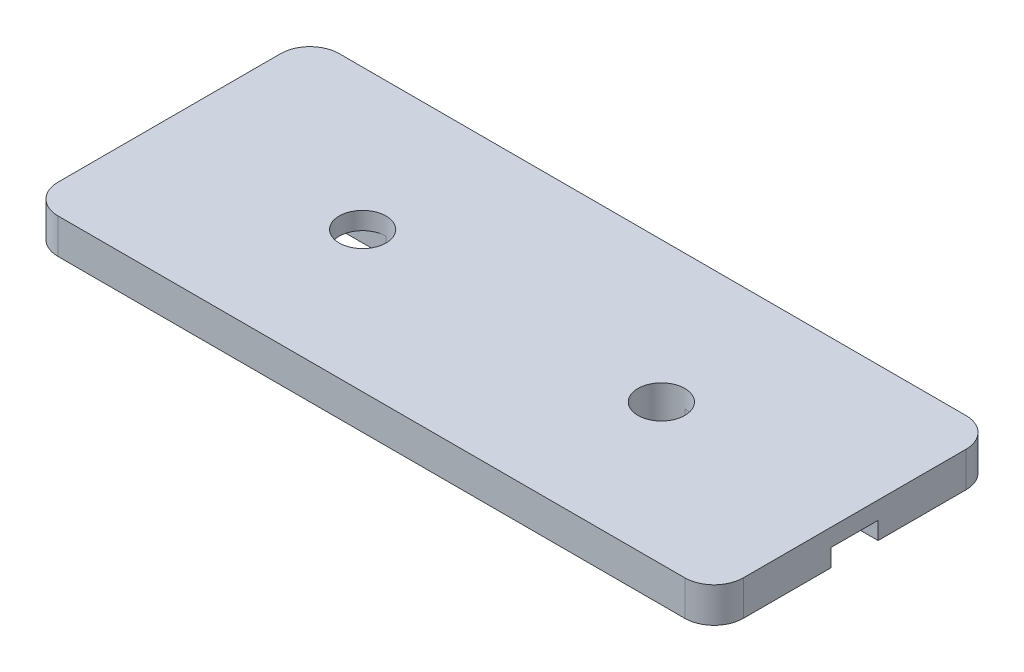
ISO-10303-21;
HEADER;
FILE_DESCRIPTION(('STEP AP214'),'2;1');
FILE_NAME('part.step','',(''),(''),'','','');
FILE_SCHEMA(('AUTOMOTIVE_DESIGN { 1 0 10303 214 1 1 1 1 }'));
ENDSEC;
DATA;
#1=APPLICATION_CONTEXT('core data for automotive mechanical design processes');
#2=APPLICATION_PROTOCOL_DEFINITION('international standard','automotive_design',2000,#1);
#3=PRODUCT_CONTEXT('',#1,'mechanical');
#4=PRODUCT('Part','Part','',(#3));
#5=PRODUCT_RELATED_PRODUCT_CATEGORY('part','',(#4));
#6=PRODUCT_DEFINITION_FORMATION('','',#4);
#7=PRODUCT_DEFINITION_CONTEXT('part definition',#1,'design');
#8=PRODUCT_DEFINITION('design','',#6,#7);
#9=PRODUCT_DEFINITION_SHAPE('','',#8);
#10=(LENGTH_UNIT() NAMED_UNIT(*) SI_UNIT(.MILLI.,.METRE.));
#11=(NAMED_UNIT(*) PLANE_ANGLE_UNIT() SI_UNIT($,.RADIAN.));
#12=(NAMED_UNIT(*) SI_UNIT($,.STERADIAN.) SOLID_ANGLE_UNIT());
#13=UNCERTAINTY_MEASURE_WITH_UNIT(LENGTH_MEASURE(1.E-05),#10,'distance_accuracy_value','');
#14=(GEOMETRIC_REPRESENTATION_CONTEXT(3) GLOBAL_UNCERTAINTY_ASSIGNED_CONTEXT((#13)) GLOBAL_UNIT_ASSIGNED_CONTEXT((#10,
#11,#12)) REPRESENTATION_CONTEXT('',''));
#15=CARTESIAN_POINT('',(0.,0.,0.));
#16=DIRECTION('',(0.,0.,1.));
#17=DIRECTION('',(1.,0.,0.));
#18=AXIS2_PLACEMENT_3D('',#15,#16,#17);
#19=CARTESIAN_POINT('',(-5.85,0.6,-2.4));
#20=DIRECTION('',(1.,0.,0.));
#21=DIRECTION('',(0.,0.,-1.));
#22=AXIS2_PLACEMENT_3D('',#19,#20,#21);
#23=PLANE('',#22);
#24=DIRECTION('',(0.,0.,1.));
#25=VECTOR('',#24,1.);
#26=CARTESIAN_POINT('',(-5.85,0.,-2.4));
#27=LINE('',#26,#25);
#28=CARTESIAN_POINT('',(-5.85,0.,-1.9));
#29=VERTEX_POINT('',#28);
#30=CARTESIAN_POINT('',(-5.85,0.,-0.399999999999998));
#31=VERTEX_POINT('',#30);
#32=EDGE_CURVE('E227',#29,#31,#27,.T.);
#33=ORIENTED_EDGE('',*,*,#32,.T.);
#34=DIRECTION('',(0.,-1.,0.));
#35=VECTOR('',#34,1.);
#36=CARTESIAN_POINT('',(-5.85,0.3,-0.399999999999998));
#37=LINE('',#36,#35);
#38=CARTESIAN_POINT('',(-5.85,0.3,-0.399999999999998));
#39=VERTEX_POINT('',#38);
#40=EDGE_CURVE('E269',#39,#31,#37,.T.);
#41=ORIENTED_EDGE('',*,*,#40,.F.);
#42=DIRECTION('',(0.,0.,-1.));
#43=VECTOR('',#42,1.);
#44=CARTESIAN_POINT('',(-5.85,0.3,-0.399999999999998));
#45=LINE('',#44,#43);
#46=CARTESIAN_POINT('',(-5.85,0.3,0.400000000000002));
#47=VERTEX_POINT('',#46);
#48=EDGE_CURVE('E257',#47,#39,#45,.T.);
#49=ORIENTED_EDGE('',*,*,#48,.F.);
#50=DIRECTION('',(0.,1.,0.));
#51=VECTOR('',#50,1.);
#52=CARTESIAN_POINT('',(-5.85,0.3,0.400000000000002));
#53=LINE('',#52,#51);
#54=CARTESIAN_POINT('',(-5.85,0.,0.400000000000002));
#55=VERTEX_POINT('',#54);
#56=EDGE_CURVE('E266',#55,#47,#53,.T.);
#57=ORIENTED_EDGE('',*,*,#56,.F.);
#58=CARTESIAN_POINT('',(-5.85,0.,1.9));
#59=VERTEX_POINT('',#58);
#60=EDGE_CURVE('E229',#55,#59,#27,.T.);
#61=ORIENTED_EDGE('',*,*,#60,.T.);
#62=DIRECTION('',(0.,-1.,0.));
#63=VECTOR('',#62,1.);
#64=CARTESIAN_POINT('',(-5.85,0.6,1.9));
#65=LINE('',#64,#63);
#66=CARTESIAN_POINT('',(-5.85,0.6,1.9));
#67=VERTEX_POINT('',#66);
#68=EDGE_CURVE('E182',#59,#67,#65,.F.);
#69=ORIENTED_EDGE('',*,*,#68,.T.);
#70=DIRECTION('',(0.,0.,1.));
#71=VECTOR('',#70,1.);
#72=CARTESIAN_POINT('',(-5.85,0.6,-2.4));
#73=LINE('',#72,#71);
#74=CARTESIAN_POINT('',(-5.85,0.6,-1.9));
#75=VERTEX_POINT('',#74);
#76=EDGE_CURVE('E176',#75,#67,#73,.T.);
#77=ORIENTED_EDGE('',*,*,#76,.F.);
#78=DIRECTION('',(0.,-1.,0.));
#79=VECTOR('',#78,1.);
#80=CARTESIAN_POINT('',(-5.85,0.6,-1.9));
#81=LINE('',#80,#79);
#82=EDGE_CURVE('E184',#75,#29,#81,.T.);
#83=ORIENTED_EDGE('',*,*,#82,.T.);
#84=EDGE_LOOP('',(#33,#41,#49,#57,#61,#69,#77,#83));
#85=FACE_BOUND('',#84,.T.);
#86=ADVANCED_FACE('F31',(#85),#23,.F.);
#87=CARTESIAN_POINT('',(-5.85,0.6,2.4));
#88=DIRECTION('',(0.,0.,-1.));
#89=DIRECTION('',(-1.,0.,0.));
#90=AXIS2_PLACEMENT_3D('',#87,#88,#89);
#91=PLANE('',#90);
#92=DIRECTION('',(1.,0.,0.));
#93=VECTOR('',#92,1.);
#94=CARTESIAN_POINT('',(-5.85,0.,2.4));
#95=LINE('',#94,#93);
#96=CARTESIAN_POINT('',(-5.35,0.,2.4));
#97=VERTEX_POINT('',#96);
#98=CARTESIAN_POINT('',(5.35,0.,2.4));
#99=VERTEX_POINT('',#98);
#100=EDGE_CURVE('E178',#97,#99,#95,.T.);
#101=ORIENTED_EDGE('',*,*,#100,.T.);
#102=DIRECTION('',(0.,-1.,0.));
#103=VECTOR('',#102,1.);
#104=CARTESIAN_POINT('',(5.35,0.6,2.4));
#105=LINE('',#104,#103);
#106=CARTESIAN_POINT('',(5.35,0.6,2.4));
#107=VERTEX_POINT('',#106);
#108=EDGE_CURVE('E11',#99,#107,#105,.F.);
#109=ORIENTED_EDGE('',*,*,#108,.T.);
#110=DIRECTION('',(1.,0.,0.));
#111=VECTOR('',#110,1.);
#112=CARTESIAN_POINT('',(-5.85,0.6,2.4));
#113=LINE('',#112,#111);
#114=CARTESIAN_POINT('',(-5.35,0.6,2.4));
#115=VERTEX_POINT('',#114);
#116=EDGE_CURVE('E222',#115,#107,#113,.T.);
#117=ORIENTED_EDGE('',*,*,#116,.F.);
#118=DIRECTION('',(0.,-1.,0.));
#119=VECTOR('',#118,1.);
#120=CARTESIAN_POINT('',(-5.35,0.6,2.4));
#121=LINE('',#120,#119);
#122=EDGE_CURVE('E39',#115,#97,#121,.T.);
#123=ORIENTED_EDGE('',*,*,#122,.T.);
#124=EDGE_LOOP('',(#101,#109,#117,#123));
#125=FACE_BOUND('',#124,.T.);
#126=ADVANCED_FACE('F219',(#125),#91,.F.);
#127=CARTESIAN_POINT('',(5.85,0.6,-2.4));
#128=DIRECTION('',(-1.,0.,0.));
#129=DIRECTION('',(0.,0.,1.));
#130=AXIS2_PLACEMENT_3D('',#127,#128,#129);
#131=PLANE('',#130);
#132=DIRECTION('',(0.,0.,-1.));
#133=VECTOR('',#132,1.);
#134=CARTESIAN_POINT('',(5.85,0.,-2.4));
#135=LINE('',#134,#133);
#136=CARTESIAN_POINT('',(5.85,0.,1.9));
#137=VERTEX_POINT('',#136);
#138=CARTESIAN_POINT('',(5.85,0.,0.400000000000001));
#139=VERTEX_POINT('',#138);
#140=EDGE_CURVE('E160',#137,#139,#135,.T.);
#141=ORIENTED_EDGE('',*,*,#140,.T.);
#142=DIRECTION('',(0.,-1.,0.));
#143=VECTOR('',#142,1.);
#144=CARTESIAN_POINT('',(5.85,0.3,0.400000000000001));
#145=LINE('',#144,#143);
#146=CARTESIAN_POINT('',(5.85,0.3,0.400000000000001));
#147=VERTEX_POINT('',#146);
#148=EDGE_CURVE('E142',#147,#139,#145,.T.);
#149=ORIENTED_EDGE('',*,*,#148,.F.);
#150=DIRECTION('',(0.,0.,1.));
#151=VECTOR('',#150,1.);
#152=CARTESIAN_POINT('',(5.85,0.3,0.400000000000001));
#153=LINE('',#152,#151);
#154=CARTESIAN_POINT('',(5.85,0.3,-0.399999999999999));
#155=VERTEX_POINT('',#154);
#156=EDGE_CURVE('E165',#155,#147,#153,.T.);
#157=ORIENTED_EDGE('',*,*,#156,.F.);
#158=DIRECTION('',(0.,1.,0.));
#159=VECTOR('',#158,1.);
#160=CARTESIAN_POINT('',(5.85,0.3,-0.399999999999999));
#161=LINE('',#160,#159);
#162=CARTESIAN_POINT('',(5.85,0.,-0.399999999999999));
#163=VERTEX_POINT('',#162);
#164=EDGE_CURVE('E153',#163,#155,#161,.T.);
#165=ORIENTED_EDGE('',*,*,#164,.F.);
#166=CARTESIAN_POINT('',(5.85,0.,-1.9));
#167=VERTEX_POINT('',#166);
#168=EDGE_CURVE('E173',#163,#167,#135,.T.);
#169=ORIENTED_EDGE('',*,*,#168,.T.);
#170=DIRECTION('',(0.,-1.,0.));
#171=VECTOR('',#170,1.);
#172=CARTESIAN_POINT('',(5.85,0.6,-1.9));
#173=LINE('',#172,#171);
#174=CARTESIAN_POINT('',(5.85,0.6,-1.9));
#175=VERTEX_POINT('',#174);
#176=EDGE_CURVE('E212',#167,#175,#173,.F.);
#177=ORIENTED_EDGE('',*,*,#176,.T.);
#178=DIRECTION('',(0.,0.,-1.));
#179=VECTOR('',#178,1.);
#180=CARTESIAN_POINT('',(5.85,0.6,-2.4));
#181=LINE('',#180,#179);
#182=CARTESIAN_POINT('',(5.85,0.6,1.9));
#183=VERTEX_POINT('',#182);
#184=EDGE_CURVE('E237',#183,#175,#181,.T.);
#185=ORIENTED_EDGE('',*,*,#184,.F.);
#186=DIRECTION('',(0.,-1.,0.));
#187=VECTOR('',#186,1.);
#188=CARTESIAN_POINT('',(5.85,0.6,1.9));
#189=LINE('',#188,#187);
#190=EDGE_CURVE('E171',#183,#137,#189,.T.);
#191=ORIENTED_EDGE('',*,*,#190,.T.);
#192=EDGE_LOOP('',(#141,#149,#157,#165,#169,#177,#185,#191));
#193=FACE_BOUND('',#192,.T.);
#194=ADVANCED_FACE('F168',(#193),#131,.F.);
#195=CARTESIAN_POINT('',(-5.85,0.6,-2.4));
#196=DIRECTION('',(0.,0.,1.));
#197=DIRECTION('',(1.,0.,0.));
#198=AXIS2_PLACEMENT_3D('',#195,#196,#197);
#199=PLANE('',#198);
#200=DIRECTION('',(-1.,0.,0.));
#201=VECTOR('',#200,1.);
#202=CARTESIAN_POINT('',(-5.85,0.,-2.4));
#203=LINE('',#202,#201);
#204=CARTESIAN_POINT('',(5.35,0.,-2.4));
#205=VERTEX_POINT('',#204);
#206=CARTESIAN_POINT('',(-5.35,0.,-2.4));
#207=VERTEX_POINT('',#206);
#208=EDGE_CURVE('E172',#205,#207,#203,.T.);
#209=ORIENTED_EDGE('',*,*,#208,.T.);
#210=DIRECTION('',(0.,-1.,0.));
#211=VECTOR('',#210,1.);
#212=CARTESIAN_POINT('',(-5.35,0.6,-2.4));
#213=LINE('',#212,#211);
#214=CARTESIAN_POINT('',(-5.35,0.6,-2.4));
#215=VERTEX_POINT('',#214);
#216=EDGE_CURVE('E201',#207,#215,#213,.F.);
#217=ORIENTED_EDGE('',*,*,#216,.T.);
#218=DIRECTION('',(-1.,0.,0.));
#219=VECTOR('',#218,1.);
#220=CARTESIAN_POINT('',(-5.85,0.6,-2.4));
#221=LINE('',#220,#219);
#222=CARTESIAN_POINT('',(5.35,0.6,-2.4));
#223=VERTEX_POINT('',#222);
#224=EDGE_CURVE('E185',#223,#215,#221,.T.);
#225=ORIENTED_EDGE('',*,*,#224,.F.);
#226=DIRECTION('',(0.,-1.,0.));
#227=VECTOR('',#226,1.);
#228=CARTESIAN_POINT('',(5.35,0.6,-2.4));
#229=LINE('',#228,#227);
#230=EDGE_CURVE('E198',#223,#205,#229,.T.);
#231=ORIENTED_EDGE('',*,*,#230,.T.);
#232=EDGE_LOOP('',(#209,#217,#225,#231));
#233=FACE_BOUND('',#232,.T.);
#234=ADVANCED_FACE('F346',(#233),#199,.F.);
#235=CARTESIAN_POINT('',(-5.85,0.6,2.4));
#236=DIRECTION('',(0.,1.,0.));
#237=DIRECTION('',(0.,0.,1.));
#238=AXIS2_PLACEMENT_3D('',#235,#236,#237);
#239=PLANE('',#238);
#240=CARTESIAN_POINT('',(2.55,0.6,0.));
#241=DIRECTION('',(0.,1.,0.));
#242=DIRECTION('',(0.,0.,1.));
#243=AXIS2_PLACEMENT_3D('',#240,#241,#242);
#244=CIRCLE('',#243,0.4);
#245=CARTESIAN_POINT('',(2.55,0.6,0.4));
#246=VERTEX_POINT('',#245);
#247=EDGE_CURVE('E248',#246,#246,#244,.T.);
#248=ORIENTED_EDGE('',*,*,#247,.F.);
#249=EDGE_LOOP('',(#248));
#250=FACE_BOUND('',#249,.T.);
#251=CARTESIAN_POINT('',(-2.55,0.6,0.));
#252=DIRECTION('',(0.,1.,0.));
#253=DIRECTION('',(0.,0.,1.));
#254=AXIS2_PLACEMENT_3D('',#251,#252,#253);
#255=CIRCLE('',#254,0.4);
#256=CARTESIAN_POINT('',(-2.55,0.6,0.4));
#257=VERTEX_POINT('',#256);
#258=EDGE_CURVE('E243',#257,#257,#255,.T.);
#259=ORIENTED_EDGE('',*,*,#258,.F.);
#260=EDGE_LOOP('',(#259));
#261=FACE_BOUND('',#260,.T.);
#262=ORIENTED_EDGE('',*,*,#224,.T.);
#263=CARTESIAN_POINT('',(-5.35,0.6,-1.9));
#264=DIRECTION('',(0.,1.,0.));
#265=DIRECTION('',(0.,0.,1.));
#266=AXIS2_PLACEMENT_3D('',#263,#264,#265);
#267=CIRCLE('',#266,0.5);
#268=EDGE_CURVE('E209',#215,#75,#267,.T.);
#269=ORIENTED_EDGE('',*,*,#268,.T.);
#270=ORIENTED_EDGE('',*,*,#76,.T.);
#271=CARTESIAN_POINT('',(-5.35,0.6,1.9));
#272=DIRECTION('',(0.,1.,0.));
#273=DIRECTION('',(0.,0.,1.));
#274=AXIS2_PLACEMENT_3D('',#271,#272,#273);
#275=CIRCLE('',#274,0.5);
#276=EDGE_CURVE('E203',#67,#115,#275,.T.);
#277=ORIENTED_EDGE('',*,*,#276,.T.);
#278=ORIENTED_EDGE('',*,*,#116,.T.);
#279=CARTESIAN_POINT('',(5.35,0.6,1.9));
#280=DIRECTION('',(0.,1.,0.));
#281=DIRECTION('',(0.,0.,1.));
#282=AXIS2_PLACEMENT_3D('',#279,#280,#281);
#283=CIRCLE('',#282,0.5);
#284=EDGE_CURVE('E205',#107,#183,#283,.T.);
#285=ORIENTED_EDGE('',*,*,#284,.T.);
#286=ORIENTED_EDGE('',*,*,#184,.T.);
#287=CARTESIAN_POINT('',(5.35,0.6,-1.9));
#288=DIRECTION('',(0.,1.,0.));
#289=DIRECTION('',(0.,0.,1.));
#290=AXIS2_PLACEMENT_3D('',#287,#288,#289);
#291=CIRCLE('',#290,0.5);
#292=EDGE_CURVE('E207',#175,#223,#291,.T.);
#293=ORIENTED_EDGE('',*,*,#292,.T.);
#294=EDGE_LOOP('',(#262,#269,#270,#277,#278,#285,#286,#293));
#295=FACE_BOUND('',#294,.T.);
#296=ADVANCED_FACE('F330',(#250,#261,#295),#239,.T.);
#297=CARTESIAN_POINT('',(-5.85,0.,2.4));
#298=DIRECTION('',(0.,1.,0.));
#299=DIRECTION('',(0.,0.,1.));
#300=AXIS2_PLACEMENT_3D('',#297,#298,#299);
#301=PLANE('',#300);
#302=CARTESIAN_POINT('',(2.55,0.,0.));
#303=DIRECTION('',(0.,1.,0.));
#304=DIRECTION('',(0.,0.,1.));
#305=AXIS2_PLACEMENT_3D('',#302,#303,#304);
#306=CIRCLE('',#305,0.4);
#307=CARTESIAN_POINT('',(2.55,0.,-0.4));
#308=VERTEX_POINT('',#307);
#309=CARTESIAN_POINT('',(2.55,0.,0.4));
#310=VERTEX_POINT('',#309);
#311=EDGE_CURVE('E163',#308,#310,#306,.T.);
#312=ORIENTED_EDGE('',*,*,#311,.T.);
#313=DIRECTION('',(1.,0.,0.));
#314=VECTOR('',#313,1.);
#315=CARTESIAN_POINT('',(-5.851,0.,0.399999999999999));
#316=LINE('',#315,#314);
#317=EDGE_CURVE('E146',#310,#139,#316,.T.);
#318=ORIENTED_EDGE('',*,*,#317,.T.);
#319=ORIENTED_EDGE('',*,*,#140,.F.);
#320=CARTESIAN_POINT('',(5.35,0.,1.9));
#321=DIRECTION('',(0.,1.,0.));
#322=DIRECTION('',(0.,0.,1.));
#323=AXIS2_PLACEMENT_3D('',#320,#321,#322);
#324=CIRCLE('',#323,0.5);
#325=EDGE_CURVE('E191',#137,#99,#324,.F.);
#326=ORIENTED_EDGE('',*,*,#325,.T.);
#327=ORIENTED_EDGE('',*,*,#100,.F.);
#328=CARTESIAN_POINT('',(-5.35,0.,1.9));
#329=DIRECTION('',(0.,1.,0.));
#330=DIRECTION('',(0.,0.,1.));
#331=AXIS2_PLACEMENT_3D('',#328,#329,#330);
#332=CIRCLE('',#331,0.5);
#333=EDGE_CURVE('E188',#97,#59,#332,.F.);
#334=ORIENTED_EDGE('',*,*,#333,.T.);
#335=ORIENTED_EDGE('',*,*,#60,.F.);
#336=DIRECTION('',(-1.,0.,0.));
#337=VECTOR('',#336,1.);
#338=CARTESIAN_POINT('',(5.851,0.,0.399999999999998));
#339=LINE('',#338,#337);
#340=CARTESIAN_POINT('',(-2.55,0.,0.400000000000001));
#341=VERTEX_POINT('',#340);
#342=EDGE_CURVE('E256',#341,#55,#339,.T.);
#343=ORIENTED_EDGE('',*,*,#342,.F.);
#344=CARTESIAN_POINT('',(-2.55,0.,0.));
#345=DIRECTION('',(0.,1.,0.));
#346=DIRECTION('',(0.,0.,1.));
#347=AXIS2_PLACEMENT_3D('',#344,#345,#346);
#348=CIRCLE('',#347,0.4);
#349=CARTESIAN_POINT('',(-2.55,0.,-0.4));
#350=VERTEX_POINT('',#349);
#351=EDGE_CURVE('E233',#341,#350,#348,.T.);
#352=ORIENTED_EDGE('',*,*,#351,.T.);
#353=DIRECTION('',(-1.,0.,0.));
#354=VECTOR('',#353,1.);
#355=CARTESIAN_POINT('',(5.851,0.,-0.400000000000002));
#356=LINE('',#355,#354);
#357=EDGE_CURVE('E253',#350,#31,#356,.T.);
#358=ORIENTED_EDGE('',*,*,#357,.T.);
#359=ORIENTED_EDGE('',*,*,#32,.F.);
#360=CARTESIAN_POINT('',(-5.35,0.,-1.9));
#361=DIRECTION('',(0.,1.,0.));
#362=DIRECTION('',(0.,0.,1.));
#363=AXIS2_PLACEMENT_3D('',#360,#361,#362);
#364=CIRCLE('',#363,0.5);
#365=EDGE_CURVE('E196',#29,#207,#364,.F.);
#366=ORIENTED_EDGE('',*,*,#365,.T.);
#367=ORIENTED_EDGE('',*,*,#208,.F.);
#368=CARTESIAN_POINT('',(5.35,0.,-1.9));
#369=DIRECTION('',(0.,1.,0.));
#370=DIRECTION('',(0.,0.,1.));
#371=AXIS2_PLACEMENT_3D('',#368,#369,#370);
#372=CIRCLE('',#371,0.5);
#373=EDGE_CURVE('E193',#205,#167,#372,.F.);
#374=ORIENTED_EDGE('',*,*,#373,.T.);
#375=ORIENTED_EDGE('',*,*,#168,.F.);
#376=DIRECTION('',(1.,0.,0.));
#377=VECTOR('',#376,1.);
#378=CARTESIAN_POINT('',(-5.851,0.,-0.400000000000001));
#379=LINE('',#378,#377);
#380=EDGE_CURVE('E164',#308,#163,#379,.T.);
#381=ORIENTED_EDGE('',*,*,#380,.F.);
#382=EDGE_LOOP('',(#312,#318,#319,#326,#327,#334,#335,#343,#352,#358,#359,#366,#367,#374,#375,#381));
#383=FACE_BOUND('',#382,.T.);
#384=ADVANCED_FACE('F159',(#383),#301,.F.);
#385=CARTESIAN_POINT('',(-5.35,0.6,-1.9));
#386=DIRECTION('',(0.,-1.,0.));
#387=DIRECTION('',(0.,0.,-1.));
#388=AXIS2_PLACEMENT_3D('',#385,#386,#387);
#389=CYLINDRICAL_SURFACE('',#388,0.5);
#390=ORIENTED_EDGE('',*,*,#268,.F.);
#391=ORIENTED_EDGE('',*,*,#216,.F.);
#392=ORIENTED_EDGE('',*,*,#365,.F.);
#393=ORIENTED_EDGE('',*,*,#82,.F.);
#394=EDGE_LOOP('',(#390,#391,#392,#393));
#395=FACE_BOUND('',#394,.T.);
#396=ADVANCED_FACE('F314',(#395),#389,.T.);
#397=CARTESIAN_POINT('',(5.35,0.6,-1.9));
#398=DIRECTION('',(0.,-1.,0.));
#399=DIRECTION('',(0.,0.,-1.));
#400=AXIS2_PLACEMENT_3D('',#397,#398,#399);
#401=CYLINDRICAL_SURFACE('',#400,0.5);
#402=ORIENTED_EDGE('',*,*,#292,.F.);
#403=ORIENTED_EDGE('',*,*,#176,.F.);
#404=ORIENTED_EDGE('',*,*,#373,.F.);
#405=ORIENTED_EDGE('',*,*,#230,.F.);
#406=EDGE_LOOP('',(#402,#403,#404,#405));
#407=FACE_BOUND('',#406,.T.);
#408=ADVANCED_FACE('F317',(#407),#401,.T.);
#409=CARTESIAN_POINT('',(5.35,0.6,1.9));
#410=DIRECTION('',(0.,-1.,0.));
#411=DIRECTION('',(0.,0.,-1.));
#412=AXIS2_PLACEMENT_3D('',#409,#410,#411);
#413=CYLINDRICAL_SURFACE('',#412,0.5);
#414=ORIENTED_EDGE('',*,*,#284,.F.);
#415=ORIENTED_EDGE('',*,*,#108,.F.);
#416=ORIENTED_EDGE('',*,*,#325,.F.);
#417=ORIENTED_EDGE('',*,*,#190,.F.);
#418=EDGE_LOOP('',(#414,#415,#416,#417));
#419=FACE_BOUND('',#418,.T.);
#420=ADVANCED_FACE('F320',(#419),#413,.T.);
#421=CARTESIAN_POINT('',(-5.35,0.6,1.9));
#422=DIRECTION('',(0.,-1.,0.));
#423=DIRECTION('',(0.,0.,-1.));
#424=AXIS2_PLACEMENT_3D('',#421,#422,#423);
#425=CYLINDRICAL_SURFACE('',#424,0.5);
#426=ORIENTED_EDGE('',*,*,#276,.F.);
#427=ORIENTED_EDGE('',*,*,#68,.F.);
#428=ORIENTED_EDGE('',*,*,#333,.F.);
#429=ORIENTED_EDGE('',*,*,#122,.F.);
#430=EDGE_LOOP('',(#426,#427,#428,#429));
#431=FACE_BOUND('',#430,.T.);
#432=ADVANCED_FACE('F33',(#431),#425,.T.);
#433=CARTESIAN_POINT('',(-2.55,0.,0.));
#434=DIRECTION('',(0.,1.,0.));
#435=DIRECTION('',(0.,0.,1.));
#436=AXIS2_PLACEMENT_3D('',#433,#434,#435);
#437=CYLINDRICAL_SURFACE('',#436,0.4);
#438=CARTESIAN_POINT('',(-2.55,0.3,0.));
#439=DIRECTION('',(0.,1.,0.));
#440=DIRECTION('',(0.,0.,1.));
#441=AXIS2_PLACEMENT_3D('',#438,#439,#440);
#442=CIRCLE('',#441,0.4);
#443=CARTESIAN_POINT('',(-2.55,0.3,-0.399999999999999));
#444=VERTEX_POINT('',#443);
#445=CARTESIAN_POINT('',(-2.55,0.3,0.400000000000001));
#446=VERTEX_POINT('',#445);
#447=EDGE_CURVE('E54',#444,#446,#442,.T.);
#448=ORIENTED_EDGE('',*,*,#447,.F.);
#449=DIRECTION('',(0.,1.,0.));
#450=VECTOR('',#449,1.);
#451=CARTESIAN_POINT('',(-2.55,0.,-0.4));
#452=LINE('',#451,#450);
#453=EDGE_CURVE('E263',#350,#444,#452,.T.);
#454=ORIENTED_EDGE('',*,*,#453,.F.);
#455=ORIENTED_EDGE('',*,*,#351,.F.);
#456=DIRECTION('',(0.,1.,0.));
#457=VECTOR('',#456,1.);
#458=CARTESIAN_POINT('',(-2.55,0.,0.400000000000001));
#459=LINE('',#458,#457);
#460=EDGE_CURVE('E251',#341,#446,#459,.T.);
#461=ORIENTED_EDGE('',*,*,#460,.T.);
#462=EDGE_LOOP('',(#448,#454,#455,#461));
#463=FACE_BOUND('',#462,.T.);
#464=ORIENTED_EDGE('',*,*,#258,.T.);
#465=EDGE_LOOP('',(#464));
#466=FACE_BOUND('',#465,.T.);
#467=ADVANCED_FACE('F327',(#463,#466),#437,.F.);
#468=CARTESIAN_POINT('',(2.55,0.,0.));
#469=DIRECTION('',(0.,1.,0.));
#470=DIRECTION('',(0.,0.,1.));
#471=AXIS2_PLACEMENT_3D('',#468,#469,#470);
#472=CYLINDRICAL_SURFACE('',#471,0.4);
#473=CARTESIAN_POINT('',(2.55,0.3,0.));
#474=DIRECTION('',(0.,1.,0.));
#475=DIRECTION('',(0.,0.,1.));
#476=AXIS2_PLACEMENT_3D('',#473,#474,#475);
#477=CIRCLE('',#476,0.4);
#478=CARTESIAN_POINT('',(2.55,0.3,0.400000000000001));
#479=VERTEX_POINT('',#478);
#480=CARTESIAN_POINT('',(2.55,0.3,-0.4));
#481=VERTEX_POINT('',#480);
#482=EDGE_CURVE('E46',#479,#481,#477,.T.);
#483=ORIENTED_EDGE('',*,*,#482,.F.);
#484=DIRECTION('',(0.,1.,0.));
#485=VECTOR('',#484,1.);
#486=CARTESIAN_POINT('',(2.55,0.,0.400000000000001));
#487=LINE('',#486,#485);
#488=EDGE_CURVE('E154',#310,#479,#487,.T.);
#489=ORIENTED_EDGE('',*,*,#488,.F.);
#490=ORIENTED_EDGE('',*,*,#311,.F.);
#491=DIRECTION('',(0.,1.,0.));
#492=VECTOR('',#491,1.);
#493=CARTESIAN_POINT('',(2.55,0.,-0.4));
#494=LINE('',#493,#492);
#495=EDGE_CURVE('E285',#308,#481,#494,.T.);
#496=ORIENTED_EDGE('',*,*,#495,.T.);
#497=EDGE_LOOP('',(#483,#489,#490,#496));
#498=FACE_BOUND('',#497,.T.);
#499=ORIENTED_EDGE('',*,*,#247,.T.);
#500=EDGE_LOOP('',(#499));
#501=FACE_BOUND('',#500,.T.);
#502=ADVANCED_FACE('F288',(#498,#501),#472,.F.);
#503=CARTESIAN_POINT('',(5.851,0.3,-0.400000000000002));
#504=DIRECTION('',(0.,0.,-1.));
#505=DIRECTION('',(0.,1.,0.));
#506=AXIS2_PLACEMENT_3D('',#503,#504,#505);
#507=PLANE('',#506);
#508=ORIENTED_EDGE('',*,*,#453,.T.);
#509=DIRECTION('',(-1.,0.,0.));
#510=VECTOR('',#509,1.);
#511=CARTESIAN_POINT('',(5.851,0.3,-0.400000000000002));
#512=LINE('',#511,#510);
#513=EDGE_CURVE('E261',#444,#39,#512,.T.);
#514=ORIENTED_EDGE('',*,*,#513,.T.);
#515=ORIENTED_EDGE('',*,*,#40,.T.);
#516=ORIENTED_EDGE('',*,*,#357,.F.);
#517=EDGE_LOOP('',(#508,#514,#515,#516));
#518=FACE_BOUND('',#517,.T.);
#519=ADVANCED_FACE('F343',(#518),#507,.F.);
#520=CARTESIAN_POINT('',(5.851,0.3,-0.400000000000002));
#521=DIRECTION('',(0.,1.,0.));
#522=DIRECTION('',(0.,0.,1.));
#523=AXIS2_PLACEMENT_3D('',#520,#521,#522);
#524=PLANE('',#523);
#525=ORIENTED_EDGE('',*,*,#447,.T.);
#526=DIRECTION('',(-1.,0.,0.));
#527=VECTOR('',#526,1.);
#528=CARTESIAN_POINT('',(5.851,0.3,0.399999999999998));
#529=LINE('',#528,#527);
#530=EDGE_CURVE('E259',#446,#47,#529,.T.);
#531=ORIENTED_EDGE('',*,*,#530,.T.);
#532=ORIENTED_EDGE('',*,*,#48,.T.);
#533=ORIENTED_EDGE('',*,*,#513,.F.);
#534=EDGE_LOOP('',(#525,#531,#532,#533));
#535=FACE_BOUND('',#534,.T.);
#536=ADVANCED_FACE('F367',(#535),#524,.F.);
#537=CARTESIAN_POINT('',(5.851,0.3,0.399999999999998));
#538=DIRECTION('',(0.,0.,1.));
#539=DIRECTION('',(1.,0.,0.));
#540=AXIS2_PLACEMENT_3D('',#537,#538,#539);
#541=PLANE('',#540);
#542=ORIENTED_EDGE('',*,*,#342,.T.);
#543=ORIENTED_EDGE('',*,*,#56,.T.);
#544=ORIENTED_EDGE('',*,*,#530,.F.);
#545=ORIENTED_EDGE('',*,*,#460,.F.);
#546=EDGE_LOOP('',(#542,#543,#544,#545));
#547=FACE_BOUND('',#546,.T.);
#548=ADVANCED_FACE('F304',(#547),#541,.F.);
#549=CARTESIAN_POINT('',(-5.851,0.3,0.399999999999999));
#550=DIRECTION('',(0.,0.,1.));
#551=DIRECTION('',(1.,0.,0.));
#552=AXIS2_PLACEMENT_3D('',#549,#550,#551);
#553=PLANE('',#552);
#554=ORIENTED_EDGE('',*,*,#488,.T.);
#555=DIRECTION('',(1.,0.,0.));
#556=VECTOR('',#555,1.);
#557=CARTESIAN_POINT('',(-5.851,0.3,0.399999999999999));
#558=LINE('',#557,#556);
#559=EDGE_CURVE('E148',#479,#147,#558,.T.);
#560=ORIENTED_EDGE('',*,*,#559,.T.);
#561=ORIENTED_EDGE('',*,*,#148,.T.);
#562=ORIENTED_EDGE('',*,*,#317,.F.);
#563=EDGE_LOOP('',(#554,#560,#561,#562));
#564=FACE_BOUND('',#563,.T.);
#565=ADVANCED_FACE('F145',(#564),#553,.F.);
#566=CARTESIAN_POINT('',(-5.851,0.3,0.399999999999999));
#567=DIRECTION('',(0.,1.,0.));
#568=DIRECTION('',(0.,0.,1.));
#569=AXIS2_PLACEMENT_3D('',#566,#567,#568);
#570=PLANE('',#569);
#571=ORIENTED_EDGE('',*,*,#482,.T.);
#572=DIRECTION('',(1.,0.,0.));
#573=VECTOR('',#572,1.);
#574=CARTESIAN_POINT('',(-5.851,0.3,-0.400000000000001));
#575=LINE('',#574,#573);
#576=EDGE_CURVE('E277',#481,#155,#575,.T.);
#577=ORIENTED_EDGE('',*,*,#576,.T.);
#578=ORIENTED_EDGE('',*,*,#156,.T.);
#579=ORIENTED_EDGE('',*,*,#559,.F.);
#580=EDGE_LOOP('',(#571,#577,#578,#579));
#581=FACE_BOUND('',#580,.T.);
#582=ADVANCED_FACE('F296',(#581),#570,.F.);
#583=CARTESIAN_POINT('',(-5.851,0.3,-0.400000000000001));
#584=DIRECTION('',(0.,0.,-1.));
#585=DIRECTION('',(0.,1.,0.));
#586=AXIS2_PLACEMENT_3D('',#583,#584,#585);
#587=PLANE('',#586);
#588=ORIENTED_EDGE('',*,*,#380,.T.);
#589=ORIENTED_EDGE('',*,*,#164,.T.);
#590=ORIENTED_EDGE('',*,*,#576,.F.);
#591=ORIENTED_EDGE('',*,*,#495,.F.);
#592=EDGE_LOOP('',(#588,#589,#590,#591));
#593=FACE_BOUND('',#592,.T.);
#594=ADVANCED_FACE('F291',(#593),#587,.F.);
#595=CLOSED_SHELL('',(#86,#126,#194,#234,#296,#384,#396,#408,#420,#432,#467,#502,#519,#536,#548,
#565,#582,#594));
#596=MANIFOLD_SOLID_BREP('B2',#595);
#597=ADVANCED_BREP_SHAPE_REPRESENTATION('',(#18,#596),#14);
#598=SHAPE_DEFINITION_REPRESENTATION(#9,#597);
ENDSEC;
END-ISO-10303-21;
